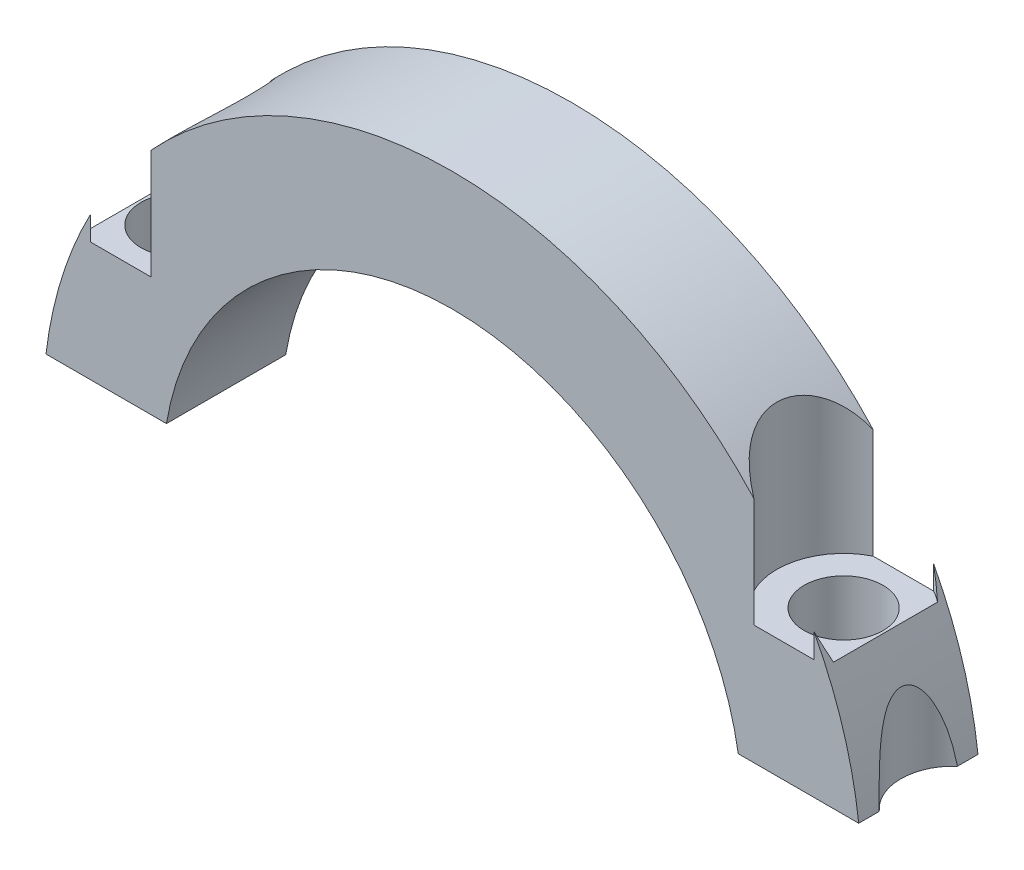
ISO-10303-21;
HEADER;
FILE_DESCRIPTION(('STEP AP214'),'2;1');
FILE_NAME('part.step','',(''),(''),'','','');
FILE_SCHEMA(('AUTOMOTIVE_DESIGN { 1 0 10303 214 1 1 1 1 }'));
ENDSEC;
DATA;
#1=APPLICATION_CONTEXT('core data for automotive mechanical design processes');
#2=APPLICATION_PROTOCOL_DEFINITION('international standard','automotive_design',2000,#1);
#3=PRODUCT_CONTEXT('',#1,'mechanical');
#4=PRODUCT('Part','Part','',(#3));
#5=PRODUCT_RELATED_PRODUCT_CATEGORY('part','',(#4));
#6=PRODUCT_DEFINITION_FORMATION('','',#4);
#7=PRODUCT_DEFINITION_CONTEXT('part definition',#1,'design');
#8=PRODUCT_DEFINITION('design','',#6,#7);
#9=PRODUCT_DEFINITION_SHAPE('','',#8);
#10=(LENGTH_UNIT() NAMED_UNIT(*) SI_UNIT(.MILLI.,.METRE.));
#11=(NAMED_UNIT(*) PLANE_ANGLE_UNIT() SI_UNIT($,.RADIAN.));
#12=(NAMED_UNIT(*) SI_UNIT($,.STERADIAN.) SOLID_ANGLE_UNIT());
#13=UNCERTAINTY_MEASURE_WITH_UNIT(LENGTH_MEASURE(1.E-05),#10,'distance_accuracy_value','');
#14=(GEOMETRIC_REPRESENTATION_CONTEXT(3) GLOBAL_UNCERTAINTY_ASSIGNED_CONTEXT((#13)) GLOBAL_UNIT_ASSIGNED_CONTEXT((#10,
#11,#12)) REPRESENTATION_CONTEXT('',''));
#15=CARTESIAN_POINT('',(0.,0.,0.));
#16=DIRECTION('',(0.,0.,1.));
#17=DIRECTION('',(1.,0.,0.));
#18=AXIS2_PLACEMENT_3D('',#15,#16,#17);
#19=CARTESIAN_POINT('',(0.,0.,2.5));
#20=DIRECTION('',(0.,0.,-1.));
#21=DIRECTION('',(-1.,0.,0.));
#22=AXIS2_PLACEMENT_3D('',#19,#20,#21);
#23=CYLINDRICAL_SURFACE('',#22,17.15);
#24=CARTESIAN_POINT('',(0.,0.,2.5));
#25=DIRECTION('',(0.,0.,1.));
#26=DIRECTION('',(-1.,0.,0.));
#27=AXIS2_PLACEMENT_3D('',#24,#25,#26);
#28=CIRCLE('',#27,17.15);
#29=CARTESIAN_POINT('',(12.6390479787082,11.5921079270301,2.5));
#30=VERTEX_POINT('',#29);
#31=CARTESIAN_POINT('',(-12.6390479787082,11.5921079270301,2.5));
#32=VERTEX_POINT('',#31);
#33=EDGE_CURVE('E385',#30,#32,#28,.T.);
#34=ORIENTED_EDGE('',*,*,#33,.F.);
#35=CARTESIAN_POINT('',(12.6390479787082,11.5921079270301,2.5));
#36=CARTESIAN_POINT('',(12.5632864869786,11.6747349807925,2.46177525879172));
#37=CARTESIAN_POINT('',(12.4876079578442,11.7555993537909,2.4192922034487));
#38=CARTESIAN_POINT('',(12.3372460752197,11.9132962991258,2.32502088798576));
#39=CARTESIAN_POINT('',(12.2625669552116,11.9901143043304,2.27320163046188));
#40=CARTESIAN_POINT('',(12.1148711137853,12.139338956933,2.15918716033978));
#41=CARTESIAN_POINT('',(12.0418765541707,12.2116974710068,2.09689918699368));
#42=CARTESIAN_POINT('',(11.8998874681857,12.3501008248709,1.96192024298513));
#43=CARTESIAN_POINT('',(11.8308869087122,12.4161552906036,1.88924557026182));
#44=CARTESIAN_POINT('',(11.6840475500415,12.5545924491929,1.71612679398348));
#45=CARTESIAN_POINT('',(11.6075642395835,12.6252123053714,1.61308330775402));
#46=CARTESIAN_POINT('',(11.4669244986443,12.7530849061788,1.39183664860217));
#47=CARTESIAN_POINT('',(11.402724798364,12.8103847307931,1.27368922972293));
#48=CARTESIAN_POINT('',(11.3182193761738,12.8849466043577,1.08591396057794));
#49=CARTESIAN_POINT('',(11.2919093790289,12.9079936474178,1.02119261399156));
#50=CARTESIAN_POINT('',(11.2438669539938,12.9498636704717,0.888767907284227));
#51=CARTESIAN_POINT('',(11.222132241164,12.9686887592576,0.821066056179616));
#52=CARTESIAN_POINT('',(11.1836722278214,13.0018700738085,0.683146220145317));
#53=CARTESIAN_POINT('',(11.1669491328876,13.0162243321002,0.61292714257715));
#54=CARTESIAN_POINT('',(11.1388873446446,13.0402462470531,0.470662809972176));
#55=CARTESIAN_POINT('',(11.1275478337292,13.0499146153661,0.398617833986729));
#56=CARTESIAN_POINT('',(11.1041891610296,13.0698095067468,0.199180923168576));
#57=CARTESIAN_POINT('',(11.0979523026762,13.0750899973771,0.0705260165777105));
#58=CARTESIAN_POINT('',(11.1032389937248,13.0705999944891,-0.186029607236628));
#59=CARTESIAN_POINT('',(11.1147536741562,13.0608370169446,-0.313930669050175));
#60=CARTESIAN_POINT('',(11.1534397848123,13.0278111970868,-0.557375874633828));
#61=CARTESIAN_POINT('',(11.179615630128,13.0054061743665,-0.673198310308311));
#62=CARTESIAN_POINT('',(11.2452850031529,12.9486654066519,-0.897886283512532));
#63=CARTESIAN_POINT('',(11.2847796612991,12.9143286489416,-1.00675122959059));
#64=CARTESIAN_POINT('',(11.3777408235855,12.8325192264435,-1.22178003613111));
#65=CARTESIAN_POINT('',(11.4319067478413,12.7843788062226,-1.32738427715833));
#66=CARTESIAN_POINT('',(11.550188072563,12.677618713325,-1.52704906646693));
#67=CARTESIAN_POINT('',(11.6143095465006,12.6189926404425,-1.62110250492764));
#68=CARTESIAN_POINT('',(11.7806017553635,12.4642648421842,-1.83688917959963));
#69=CARTESIAN_POINT('',(11.886869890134,12.3632021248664,-1.95191648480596));
#70=CARTESIAN_POINT('',(12.1082908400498,12.1464339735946,-2.15700045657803));
#71=CARTESIAN_POINT('',(12.223460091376,12.0307011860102,-2.24700944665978));
#72=CARTESIAN_POINT('',(12.3898300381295,11.858318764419,-2.35858514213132));
#73=CARTESIAN_POINT('',(12.4395613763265,11.8061478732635,-2.38965791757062));
#74=CARTESIAN_POINT('',(12.5391860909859,11.7002805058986,-2.44775195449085));
#75=CARTESIAN_POINT('',(12.5890775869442,11.6465924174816,-2.47479169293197));
#76=CARTESIAN_POINT('',(12.6390479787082,11.5921079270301,-2.5));
#77=B_SPLINE_CURVE_WITH_KNOTS('',3,(#35,#36,#37,#38,#39,#40,#41,#42,#43,#44,#45,#46,#47,#48,#49,
#50,#51,#52,#53,#54,#55,#56,#57,#58,#59,#60,#61,#62,#63,#64,#65,#66,#67,#68,#69,#70,#71,#72,#73,
#74,#75,#76),.UNSPECIFIED.,.F.,.F.,(4,2,2,2,2,2,2,2,2,2,2,2,2,2,2,2,2,2,2,2,4),(0.,
0.355369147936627,0.711940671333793,1.07185659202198,1.43121383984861,1.86896240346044,
2.30513937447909,2.52557059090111,2.7458914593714,2.96630914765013,3.18669335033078,
3.57119488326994,3.95550437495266,4.31642331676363,4.67737289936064,5.06010828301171,
5.44307808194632,5.99916162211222,6.55629771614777,6.79167534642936,7.02593910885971),.UNSPECIFIED.);
#78=CARTESIAN_POINT('',(12.6390479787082,11.5921079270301,-2.5));
#79=VERTEX_POINT('',#78);
#80=EDGE_CURVE('E161',#30,#79,#77,.T.);
#81=ORIENTED_EDGE('',*,*,#80,.T.);
#82=CARTESIAN_POINT('',(0.,0.,-2.5));
#83=DIRECTION('',(0.,0.,1.));
#84=DIRECTION('',(-1.,0.,0.));
#85=AXIS2_PLACEMENT_3D('',#82,#83,#84);
#86=CIRCLE('',#85,17.15);
#87=CARTESIAN_POINT('',(-12.6390479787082,11.5921079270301,-2.5));
#88=VERTEX_POINT('',#87);
#89=EDGE_CURVE('E359',#79,#88,#86,.T.);
#90=ORIENTED_EDGE('',*,*,#89,.T.);
#91=CARTESIAN_POINT('',(-12.6390479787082,11.5921079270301,2.5));
#92=CARTESIAN_POINT('',(-12.5632864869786,11.6747349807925,2.46177525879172));
#93=CARTESIAN_POINT('',(-12.4876079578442,11.7555993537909,2.4192922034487));
#94=CARTESIAN_POINT('',(-12.3372460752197,11.9132962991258,2.32502088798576));
#95=CARTESIAN_POINT('',(-12.2625669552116,11.9901143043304,2.27320163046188));
#96=CARTESIAN_POINT('',(-12.1148711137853,12.139338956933,2.15918716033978));
#97=CARTESIAN_POINT('',(-12.0418765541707,12.2116974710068,2.09689918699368));
#98=CARTESIAN_POINT('',(-11.8998874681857,12.3501008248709,1.96192024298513));
#99=CARTESIAN_POINT('',(-11.8308869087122,12.4161552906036,1.88924557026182));
#100=CARTESIAN_POINT('',(-11.6840475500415,12.5545924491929,1.71612679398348));
#101=CARTESIAN_POINT('',(-11.6075642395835,12.6252123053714,1.61308330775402));
#102=CARTESIAN_POINT('',(-11.4669244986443,12.7530849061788,1.39183664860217));
#103=CARTESIAN_POINT('',(-11.402724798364,12.8103847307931,1.27368922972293));
#104=CARTESIAN_POINT('',(-11.3182193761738,12.8849466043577,1.08591396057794));
#105=CARTESIAN_POINT('',(-11.2919093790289,12.9079936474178,1.02119261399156));
#106=CARTESIAN_POINT('',(-11.2438669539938,12.9498636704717,0.888767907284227));
#107=CARTESIAN_POINT('',(-11.222132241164,12.9686887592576,0.821066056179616));
#108=CARTESIAN_POINT('',(-11.1836722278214,13.0018700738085,0.683146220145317));
#109=CARTESIAN_POINT('',(-11.1669491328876,13.0162243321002,0.61292714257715));
#110=CARTESIAN_POINT('',(-11.1388873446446,13.0402462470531,0.470662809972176));
#111=CARTESIAN_POINT('',(-11.1275478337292,13.0499146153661,0.398617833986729));
#112=CARTESIAN_POINT('',(-11.1041891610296,13.0698095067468,0.199180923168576));
#113=CARTESIAN_POINT('',(-11.0979523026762,13.0750899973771,0.0705260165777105));
#114=CARTESIAN_POINT('',(-11.1032389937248,13.0705999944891,-0.186029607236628));
#115=CARTESIAN_POINT('',(-11.1147536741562,13.0608370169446,-0.313930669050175));
#116=CARTESIAN_POINT('',(-11.1534397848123,13.0278111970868,-0.557375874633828));
#117=CARTESIAN_POINT('',(-11.179615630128,13.0054061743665,-0.673198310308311));
#118=CARTESIAN_POINT('',(-11.2452850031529,12.9486654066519,-0.897886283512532));
#119=CARTESIAN_POINT('',(-11.2847796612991,12.9143286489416,-1.00675122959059));
#120=CARTESIAN_POINT('',(-11.3777408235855,12.8325192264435,-1.22178003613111));
#121=CARTESIAN_POINT('',(-11.4319067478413,12.7843788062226,-1.32738427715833));
#122=CARTESIAN_POINT('',(-11.550188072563,12.677618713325,-1.52704906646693));
#123=CARTESIAN_POINT('',(-11.6143095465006,12.6189926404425,-1.62110250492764));
#124=CARTESIAN_POINT('',(-11.7806017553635,12.4642648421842,-1.83688917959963));
#125=CARTESIAN_POINT('',(-11.886869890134,12.3632021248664,-1.95191648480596));
#126=CARTESIAN_POINT('',(-12.1082908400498,12.1464339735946,-2.15700045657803));
#127=CARTESIAN_POINT('',(-12.223460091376,12.0307011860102,-2.24700944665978));
#128=CARTESIAN_POINT('',(-12.3898300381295,11.858318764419,-2.35858514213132));
#129=CARTESIAN_POINT('',(-12.4395613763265,11.8061478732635,-2.38965791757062));
#130=CARTESIAN_POINT('',(-12.5391860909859,11.7002805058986,-2.44775195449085));
#131=CARTESIAN_POINT('',(-12.5890775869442,11.6465924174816,-2.47479169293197));
#132=CARTESIAN_POINT('',(-12.6390479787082,11.5921079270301,-2.5));
#133=B_SPLINE_CURVE_WITH_KNOTS('',3,(#91,#92,#93,#94,#95,#96,#97,#98,#99,#100,#101,#102,#103,
#104,#105,#106,#107,#108,#109,#110,#111,#112,#113,#114,#115,#116,#117,#118,#119,#120,#121,#122,
#123,#124,#125,#126,#127,#128,#129,#130,#131,#132),.UNSPECIFIED.,.F.,.F.,(4,2,2,2,2,2,2,2,2,2,2,
2,2,2,2,2,2,2,2,2,4),(0.,0.355369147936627,0.711940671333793,1.07185659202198,1.43121383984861,
1.86896240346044,2.30513937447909,2.52557059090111,2.7458914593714,2.96630914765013,
3.18669335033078,3.57119488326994,3.95550437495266,4.31642331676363,4.67737289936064,
5.06010828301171,5.44307808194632,5.99916162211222,6.55629771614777,6.79167534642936,
7.02593910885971),.UNSPECIFIED.);
#134=EDGE_CURVE('E274',#32,#88,#133,.T.);
#135=ORIENTED_EDGE('',*,*,#134,.F.);
#136=EDGE_LOOP('',(#34,#81,#90,#135));
#137=FACE_BOUND('',#136,.T.);
#138=ADVANCED_FACE('F42',(#137),#23,.T.);
#139=CARTESIAN_POINT('',(13.9,17.15,0.));
#140=DIRECTION('',(0.,-1.,0.));
#141=DIRECTION('',(0.,0.,-1.));
#142=AXIS2_PLACEMENT_3D('',#139,#140,#141);
#143=CYLINDRICAL_SURFACE('',#142,1.65);
#144=CARTESIAN_POINT('',(13.9,2.,0.));
#145=DIRECTION('',(0.,1.,0.));
#146=DIRECTION('',(0.,0.,-1.));
#147=AXIS2_PLACEMENT_3D('',#144,#145,#146);
#148=CIRCLE('',#147,1.65);
#149=CARTESIAN_POINT('',(13.9,2.,-1.65));
#150=VERTEX_POINT('',#149);
#151=EDGE_CURVE('E231',#150,#150,#148,.T.);
#152=ORIENTED_EDGE('',*,*,#151,.F.);
#153=EDGE_LOOP('',(#152));
#154=FACE_BOUND('',#153,.T.);
#155=CARTESIAN_POINT('',(13.9,7.,0.));
#156=DIRECTION('',(0.,1.,0.));
#157=DIRECTION('',(0.,0.,1.));
#158=AXIS2_PLACEMENT_3D('',#155,#156,#157);
#159=CIRCLE('',#158,1.65);
#160=CARTESIAN_POINT('',(13.9,7.,1.65));
#161=VERTEX_POINT('',#160);
#162=EDGE_CURVE('E175',#161,#161,#159,.T.);
#163=ORIENTED_EDGE('',*,*,#162,.T.);
#164=EDGE_LOOP('',(#163));
#165=FACE_BOUND('',#164,.T.);
#166=ADVANCED_FACE('F209',(#154,#165),#143,.F.);
#167=CARTESIAN_POINT('',(17.0329827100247,2.,-2.5));
#168=VERTEX_POINT('',#167);
#169=CARTESIAN_POINT('',(15.1609520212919,8.01673461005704,-2.5));
#170=VERTEX_POINT('',#169);
#171=EDGE_CURVE('E351',#168,#170,#86,.T.);
#172=ORIENTED_EDGE('',*,*,#171,.T.);
#173=CARTESIAN_POINT('',(15.1609520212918,8.01673461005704,-2.5));
#174=CARTESIAN_POINT('',(15.2055486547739,7.93239589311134,-2.47750353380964));
#175=CARTESIAN_POINT('',(15.2493214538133,7.84791056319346,-2.45393127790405));
#176=CARTESIAN_POINT('',(15.3351880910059,7.67876892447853,-2.40472147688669));
#177=CARTESIAN_POINT('',(15.3772831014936,7.59411278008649,-2.37908541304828));
#178=CARTESIAN_POINT('',(15.4598260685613,7.42463210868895,-2.32580224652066));
#179=CARTESIAN_POINT('',(15.5002740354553,7.33980758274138,-2.29815515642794));
#180=CARTESIAN_POINT('',(15.5795526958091,7.16999497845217,-2.24086859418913));
#181=CARTESIAN_POINT('',(15.6183822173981,7.08500682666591,-2.21122771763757));
#182=CARTESIAN_POINT('',(15.6563884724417,6.99999999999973,-2.18061907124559));
#183=B_SPLINE_CURVE_WITH_KNOTS('',3,(#173,#174,#175,#176,#177,#178,#179,#180,#181,#182),
.UNSPECIFIED.,.F.,.F.,(4,2,2,2,4),(0.,0.294048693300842,0.587888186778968,0.881725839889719,
1.1757726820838),.UNSPECIFIED.);
#184=CARTESIAN_POINT('',(15.6563884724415,7.,-2.18061907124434));
#185=VERTEX_POINT('',#184);
#186=EDGE_CURVE('E166',#170,#185,#183,.T.);
#187=ORIENTED_EDGE('',*,*,#186,.T.);
#188=DIRECTION('',(0.,0.,-1.));
#189=VECTOR('',#188,1.);
#190=CARTESIAN_POINT('',(15.6563884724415,7.,2.5));
#191=LINE('',#190,#189);
#192=CARTESIAN_POINT('',(15.6563884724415,7.,2.18061907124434));
#193=VERTEX_POINT('',#192);
#194=EDGE_CURVE('E183',#193,#185,#191,.T.);
#195=ORIENTED_EDGE('',*,*,#194,.F.);
#196=CARTESIAN_POINT('',(15.6563884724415,7.,2.18061907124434));
#197=CARTESIAN_POINT('',(15.6183822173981,7.08500682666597,2.21122771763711));
#198=CARTESIAN_POINT('',(15.5795526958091,7.16999497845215,2.24086859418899));
#199=CARTESIAN_POINT('',(15.5002740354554,7.33980758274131,2.29815515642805));
#200=CARTESIAN_POINT('',(15.4598260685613,7.42463210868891,2.32580224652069));
#201=CARTESIAN_POINT('',(15.3772831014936,7.59411278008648,2.37908541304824));
#202=CARTESIAN_POINT('',(15.3351880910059,7.67876892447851,2.40472147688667));
#203=CARTESIAN_POINT('',(15.2493214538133,7.84791056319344,2.45393127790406));
#204=CARTESIAN_POINT('',(15.2055486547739,7.93239589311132,2.47750353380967));
#205=CARTESIAN_POINT('',(15.1609520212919,8.01673461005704,2.5));
#206=B_SPLINE_CURVE_WITH_KNOTS('',3,(#196,#197,#198,#199,#200,#201,#202,#203,#204,#205),
.UNSPECIFIED.,.F.,.F.,(4,2,2,2,4),(0.,0.294046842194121,0.587884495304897,0.881723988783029,
1.17577268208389),.UNSPECIFIED.);
#207=CARTESIAN_POINT('',(15.1609520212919,8.01673461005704,2.5));
#208=VERTEX_POINT('',#207);
#209=EDGE_CURVE('E222',#193,#208,#206,.T.);
#210=ORIENTED_EDGE('',*,*,#209,.T.);
#211=CARTESIAN_POINT('',(17.0329827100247,2.,2.5));
#212=VERTEX_POINT('',#211);
#213=EDGE_CURVE('E383',#212,#208,#28,.T.);
#214=ORIENTED_EDGE('',*,*,#213,.F.);
#215=DIRECTION('',(0.,0.,-1.));
#216=VECTOR('',#215,1.);
#217=CARTESIAN_POINT('',(17.0329827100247,2.,2.5));
#218=LINE('',#217,#216);
#219=CARTESIAN_POINT('',(17.0329827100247,2.,1.6394695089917));
#220=VERTEX_POINT('',#219);
#221=EDGE_CURVE('E403',#212,#220,#218,.T.);
#222=ORIENTED_EDGE('',*,*,#221,.T.);
#223=CARTESIAN_POINT('',(17.0329827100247,2.,-1.63946950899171));
#224=CARTESIAN_POINT('',(17.0224368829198,2.08981881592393,-1.63002604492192));
#225=CARTESIAN_POINT('',(17.0111887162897,2.17947409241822,-1.61978447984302));
#226=CARTESIAN_POINT('',(16.9873076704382,2.3583936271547,-1.59750880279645));
#227=CARTESIAN_POINT('',(16.9746745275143,2.44765780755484,-1.58547434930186));
#228=CARTESIAN_POINT('',(16.9479785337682,2.62615825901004,-1.55935248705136));
#229=CARTESIAN_POINT('',(16.9339086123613,2.71539198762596,-1.54525476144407));
#230=CARTESIAN_POINT('',(16.9044318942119,2.89323634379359,-1.51479576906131));
#231=CARTESIAN_POINT('',(16.8890251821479,2.98184701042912,-1.49843464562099));
#232=CARTESIAN_POINT('',(16.8398646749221,3.25200999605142,-1.44444276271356));
#233=CARTESIAN_POINT('',(16.8039894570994,3.43241474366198,-1.40266407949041));
#234=CARTESIAN_POINT('',(16.7465844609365,3.6990109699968,-1.32908905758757));
#235=CARTESIAN_POINT('',(16.7268716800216,3.78712414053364,-1.30277709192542));
#236=CARTESIAN_POINT('',(16.6863896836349,3.96167996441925,-1.24581192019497));
#237=CARTESIAN_POINT('',(16.6656208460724,4.04812320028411,-1.21516026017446));
#238=CARTESIAN_POINT('',(16.6303727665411,4.19006094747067,-1.15981691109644));
#239=CARTESIAN_POINT('',(16.6161278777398,4.24618473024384,-1.1365887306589));
#240=CARTESIAN_POINT('',(16.5873589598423,4.35721354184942,-1.08748137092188));
#241=CARTESIAN_POINT('',(16.5728348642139,4.41211827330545,-1.06160155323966));
#242=CARTESIAN_POINT('',(16.5436976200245,4.52014215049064,-1.00689550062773));
#243=CARTESIAN_POINT('',(16.5290850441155,4.5732674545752,-0.978081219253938));
#244=CARTESIAN_POINT('',(16.4999058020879,4.67744947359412,-0.916934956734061));
#245=CARTESIAN_POINT('',(16.4853391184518,4.72850709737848,-0.884604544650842));
#246=CARTESIAN_POINT('',(16.4533381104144,4.83881584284,-0.808241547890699));
#247=CARTESIAN_POINT('',(16.4359772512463,4.89740109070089,-0.763198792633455));
#248=CARTESIAN_POINT('',(16.4024740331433,5.00846168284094,-0.665616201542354));
#249=CARTESIAN_POINT('',(16.3863302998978,5.06094395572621,-0.613085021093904));
#250=CARTESIAN_POINT('',(16.3612183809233,5.141422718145,-0.516959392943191));
#251=CARTESIAN_POINT('',(16.3515821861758,5.17195202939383,-0.475684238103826));
#252=CARTESIAN_POINT('',(16.3341676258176,5.22669015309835,-0.388749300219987));
#253=CARTESIAN_POINT('',(16.326386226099,5.25090929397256,-0.343096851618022));
#254=CARTESIAN_POINT('',(16.3148307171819,5.28668879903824,-0.257829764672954));
#255=CARTESIAN_POINT('',(16.3105583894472,5.29983892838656,-0.218957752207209));
#256=CARTESIAN_POINT('',(16.3040631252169,5.31978740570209,-0.139449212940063));
#257=CARTESIAN_POINT('',(16.3018380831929,5.32659227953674,-0.0988145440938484));
#258=CARTESIAN_POINT('',(16.2996794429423,5.33319453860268,-0.0167360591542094));
#259=CARTESIAN_POINT('',(16.2997553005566,5.33296300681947,0.02471039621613));
#260=CARTESIAN_POINT('',(16.3022132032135,5.325444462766,0.10689112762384));
#261=CARTESIAN_POINT('',(16.3045963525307,5.31815407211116,0.14762505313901));
#262=CARTESIAN_POINT('',(16.3112211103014,5.29779864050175,0.225131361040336));
#263=CARTESIAN_POINT('',(16.3153591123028,5.28505521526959,0.261999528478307));
#264=CARTESIAN_POINT('',(16.3251238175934,5.25481547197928,0.333492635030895));
#265=CARTESIAN_POINT('',(16.3307510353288,5.23731751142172,0.368116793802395));
#266=CARTESIAN_POINT('',(16.3474945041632,5.1848924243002,0.458327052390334));
#267=CARTESIAN_POINT('',(16.3596939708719,5.14634412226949,0.511600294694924));
#268=CARTESIAN_POINT('',(16.3860299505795,5.06186653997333,0.611402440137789));
#269=CARTESIAN_POINT('',(16.400172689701,5.01591345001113,0.657908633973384));
#270=CARTESIAN_POINT('',(16.4282857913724,4.92301655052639,0.741468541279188));
#271=CARTESIAN_POINT('',(16.4421769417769,4.87645601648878,0.778983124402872));
#272=CARTESIAN_POINT('',(16.4703864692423,4.78031206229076,0.849777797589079));
#273=CARTESIAN_POINT('',(16.4847052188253,4.73072596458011,0.88305405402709));
#274=CARTESIAN_POINT('',(16.5134930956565,4.62923707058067,0.946039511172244));
#275=CARTESIAN_POINT('',(16.5279624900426,4.57732928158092,0.975740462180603));
#276=CARTESIAN_POINT('',(16.5568122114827,4.47185205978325,1.03199728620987));
#277=CARTESIAN_POINT('',(16.5711925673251,4.41828320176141,1.05855423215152));
#278=CARTESIAN_POINT('',(16.605512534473,4.28784973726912,1.11918704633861));
#279=CARTESIAN_POINT('',(16.6253423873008,4.21034529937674,1.1519462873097));
#280=CARTESIAN_POINT('',(16.6642954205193,4.053431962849,1.21305104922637));
#281=CARTESIAN_POINT('',(16.6834183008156,3.97402227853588,1.24139471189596));
#282=CARTESIAN_POINT('',(16.739509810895,3.73341720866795,1.32095888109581));
#283=CARTESIAN_POINT('',(16.7751430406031,3.57006589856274,1.36661602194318));
#284=CARTESIAN_POINT('',(16.8420810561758,3.23965100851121,1.44706965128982));
#285=CARTESIAN_POINT('',(16.8733782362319,3.07258148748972,1.48184718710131));
#286=CARTESIAN_POINT('',(16.9312015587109,2.73606593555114,1.542932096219));
#287=CARTESIAN_POINT('',(16.9577268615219,2.56661949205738,1.56923797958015));
#288=CARTESIAN_POINT('',(16.9910580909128,2.3304270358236,1.60101681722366));
#289=CARTESIAN_POINT('',(16.9999910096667,2.26434584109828,1.6093811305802));
#290=CARTESIAN_POINT('',(17.017068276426,2.13220708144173,1.62513037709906));
#291=CARTESIAN_POINT('',(17.0252153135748,2.06615026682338,1.6325186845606));
#292=CARTESIAN_POINT('',(17.0329827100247,2.,1.63946950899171));
#293=B_SPLINE_CURVE_WITH_KNOTS('',3,(#223,#224,#225,#226,#227,#228,#229,#230,#231,#232,#233,
#234,#235,#236,#237,#238,#239,#240,#241,#242,#243,#244,#245,#246,#247,#248,#249,#250,#251,#252,
#253,#254,#255,#256,#257,#258,#259,#260,#261,#262,#263,#264,#265,#266,#267,#268,#269,#270,#271,
#272,#273,#274,#275,#276,#277,#278,#279,#280,#281,#282,#283,#284,#285,#286,#287,#288,#289,#290,
#291,#292),.UNSPECIFIED.,.F.,.F.,(4,2,2,2,2,2,2,2,2,2,2,2,2,2,2,2,2,2,2,2,2,2,2,2,2,2,2,2,2,2,2,
2,2,2,4),(0.,0.272779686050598,0.545611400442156,0.819857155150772,1.09408555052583,
1.65929269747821,1.94134814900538,2.22330336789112,2.41041367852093,2.59756914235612,
2.78399060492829,2.97032921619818,3.19762644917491,3.42466306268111,3.58092181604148,
3.73692317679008,3.86019642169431,3.98334274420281,4.10699522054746,4.23070690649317,
4.34795490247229,4.46524345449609,4.6647207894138,4.8648528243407,5.04873792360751,
5.23278818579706,5.41725530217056,5.6016592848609,5.86082309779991,6.12009568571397,
6.6393794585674,7.15956287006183,7.67983771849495,7.88144452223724,8.0823349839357),.UNSPECIFIED.);
#294=CARTESIAN_POINT('',(17.0329827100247,2.,-1.6394695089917));
#295=VERTEX_POINT('',#294);
#296=EDGE_CURVE('E64',#295,#220,#293,.T.);
#297=ORIENTED_EDGE('',*,*,#296,.F.);
#298=EDGE_CURVE('E354',#295,#168,#218,.T.);
#299=ORIENTED_EDGE('',*,*,#298,.T.);
#300=EDGE_LOOP('',(#172,#187,#195,#210,#214,#222,#297,#299));
#301=FACE_BOUND('',#300,.T.);
#302=ADVANCED_FACE('F198',(#301),#23,.T.);
#303=CARTESIAN_POINT('',(-15.1609520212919,8.01673461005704,-2.5));
#304=CARTESIAN_POINT('',(-15.2055486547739,7.93239589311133,-2.47750353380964));
#305=CARTESIAN_POINT('',(-15.2493214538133,7.84791056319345,-2.45393127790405));
#306=CARTESIAN_POINT('',(-15.3351880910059,7.67876892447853,-2.40472147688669));
#307=CARTESIAN_POINT('',(-15.3772831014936,7.59411278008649,-2.37908541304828));
#308=CARTESIAN_POINT('',(-15.4598260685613,7.42463210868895,-2.32580224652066));
#309=CARTESIAN_POINT('',(-15.5002740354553,7.33980758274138,-2.29815515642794));
#310=CARTESIAN_POINT('',(-15.5795526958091,7.16999497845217,-2.24086859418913));
#311=CARTESIAN_POINT('',(-15.6183822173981,7.08500682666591,-2.21122771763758));
#312=CARTESIAN_POINT('',(-15.6563884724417,6.99999999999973,-2.18061907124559));
#313=B_SPLINE_CURVE_WITH_KNOTS('',3,(#303,#304,#305,#306,#307,#308,#309,#310,#311,#312),
.UNSPECIFIED.,.F.,.F.,(4,2,2,2,4),(0.,0.294048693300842,0.587888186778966,0.881725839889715,
1.1757726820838),.UNSPECIFIED.);
#314=CARTESIAN_POINT('',(-15.1609520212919,8.01673461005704,-2.5));
#315=VERTEX_POINT('',#314);
#316=CARTESIAN_POINT('',(-15.6563884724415,7.,-2.18061907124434));
#317=VERTEX_POINT('',#316);
#318=EDGE_CURVE('E266',#315,#317,#313,.T.);
#319=ORIENTED_EDGE('',*,*,#318,.F.);
#320=CARTESIAN_POINT('',(-17.0329827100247,2.,-2.5));
#321=VERTEX_POINT('',#320);
#322=EDGE_CURVE('E361',#315,#321,#86,.T.);
#323=ORIENTED_EDGE('',*,*,#322,.T.);
#324=DIRECTION('',(0.,0.,-1.));
#325=VECTOR('',#324,1.);
#326=CARTESIAN_POINT('',(-17.0329827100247,2.,2.5));
#327=LINE('',#326,#325);
#328=CARTESIAN_POINT('',(-17.0329827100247,2.,-1.63946950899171));
#329=VERTEX_POINT('',#328);
#330=EDGE_CURVE('E438',#329,#321,#327,.T.);
#331=ORIENTED_EDGE('',*,*,#330,.F.);
#332=CARTESIAN_POINT('',(-17.0329827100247,2.,-1.6394695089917));
#333=CARTESIAN_POINT('',(-17.0224368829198,2.08981881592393,-1.63002604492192));
#334=CARTESIAN_POINT('',(-17.0111887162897,2.17947409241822,-1.61978447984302));
#335=CARTESIAN_POINT('',(-16.9873076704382,2.3583936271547,-1.59750880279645));
#336=CARTESIAN_POINT('',(-16.9746745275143,2.44765780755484,-1.58547434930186));
#337=CARTESIAN_POINT('',(-16.9479785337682,2.62615825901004,-1.55935248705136));
#338=CARTESIAN_POINT('',(-16.9339086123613,2.71539198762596,-1.54525476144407));
#339=CARTESIAN_POINT('',(-16.9044318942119,2.8932363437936,-1.51479576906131));
#340=CARTESIAN_POINT('',(-16.8890251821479,2.98184701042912,-1.49843464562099));
#341=CARTESIAN_POINT('',(-16.8398646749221,3.25200999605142,-1.44444276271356));
#342=CARTESIAN_POINT('',(-16.8039894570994,3.43241474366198,-1.40266407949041));
#343=CARTESIAN_POINT('',(-16.7465844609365,3.6990109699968,-1.32908905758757));
#344=CARTESIAN_POINT('',(-16.7268716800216,3.78712414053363,-1.30277709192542));
#345=CARTESIAN_POINT('',(-16.6863896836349,3.96167996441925,-1.24581192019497));
#346=CARTESIAN_POINT('',(-16.6656208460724,4.04812320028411,-1.21516026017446));
#347=CARTESIAN_POINT('',(-16.6303727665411,4.19006094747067,-1.15981691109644));
#348=CARTESIAN_POINT('',(-16.6161278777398,4.24618473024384,-1.1365887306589));
#349=CARTESIAN_POINT('',(-16.5873589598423,4.35721354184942,-1.08748137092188));
#350=CARTESIAN_POINT('',(-16.5728348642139,4.41211827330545,-1.06160155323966));
#351=CARTESIAN_POINT('',(-16.5436976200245,4.52014215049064,-1.00689550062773));
#352=CARTESIAN_POINT('',(-16.5290850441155,4.5732674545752,-0.978081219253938));
#353=CARTESIAN_POINT('',(-16.4999058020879,4.67744947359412,-0.916934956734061));
#354=CARTESIAN_POINT('',(-16.4853391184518,4.72850709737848,-0.884604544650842));
#355=CARTESIAN_POINT('',(-16.4533381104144,4.83881584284,-0.808241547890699));
#356=CARTESIAN_POINT('',(-16.4359772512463,4.89740109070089,-0.763198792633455));
#357=CARTESIAN_POINT('',(-16.4024740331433,5.00846168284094,-0.665616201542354));
#358=CARTESIAN_POINT('',(-16.3863302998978,5.06094395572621,-0.613085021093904));
#359=CARTESIAN_POINT('',(-16.3612183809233,5.141422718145,-0.516959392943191));
#360=CARTESIAN_POINT('',(-16.3515821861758,5.17195202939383,-0.475684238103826));
#361=CARTESIAN_POINT('',(-16.3341676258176,5.22669015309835,-0.388749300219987));
#362=CARTESIAN_POINT('',(-16.326386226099,5.25090929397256,-0.343096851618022));
#363=CARTESIAN_POINT('',(-16.3148307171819,5.28668879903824,-0.257829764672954));
#364=CARTESIAN_POINT('',(-16.3105583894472,5.29983892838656,-0.218957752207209));
#365=CARTESIAN_POINT('',(-16.3040631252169,5.31978740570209,-0.139449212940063));
#366=CARTESIAN_POINT('',(-16.3018380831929,5.32659227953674,-0.0988145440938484));
#367=CARTESIAN_POINT('',(-16.2996794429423,5.33319453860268,-0.0167360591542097));
#368=CARTESIAN_POINT('',(-16.2997553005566,5.33296300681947,0.0247103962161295));
#369=CARTESIAN_POINT('',(-16.3022132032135,5.325444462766,0.106891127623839));
#370=CARTESIAN_POINT('',(-16.3045963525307,5.31815407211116,0.14762505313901));
#371=CARTESIAN_POINT('',(-16.3112211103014,5.29779864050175,0.225131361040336));
#372=CARTESIAN_POINT('',(-16.3153591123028,5.28505521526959,0.261999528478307));
#373=CARTESIAN_POINT('',(-16.3251238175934,5.25481547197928,0.333492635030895));
#374=CARTESIAN_POINT('',(-16.3307510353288,5.23731751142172,0.368116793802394));
#375=CARTESIAN_POINT('',(-16.3474945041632,5.1848924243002,0.458327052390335));
#376=CARTESIAN_POINT('',(-16.3596939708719,5.1463441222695,0.51160029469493));
#377=CARTESIAN_POINT('',(-16.3860299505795,5.06186653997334,0.611402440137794));
#378=CARTESIAN_POINT('',(-16.400172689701,5.01591345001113,0.657908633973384));
#379=CARTESIAN_POINT('',(-16.4282857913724,4.92301655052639,0.741468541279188));
#380=CARTESIAN_POINT('',(-16.442176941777,4.87645601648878,0.778983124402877));
#381=CARTESIAN_POINT('',(-16.4703864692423,4.78031206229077,0.849777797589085));
#382=CARTESIAN_POINT('',(-16.4847052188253,4.73072596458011,0.883054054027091));
#383=CARTESIAN_POINT('',(-16.5134930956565,4.62923707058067,0.946039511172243));
#384=CARTESIAN_POINT('',(-16.5279624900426,4.57732928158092,0.975740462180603));
#385=CARTESIAN_POINT('',(-16.5568122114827,4.47185205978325,1.03199728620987));
#386=CARTESIAN_POINT('',(-16.5711925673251,4.41828320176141,1.05855423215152));
#387=CARTESIAN_POINT('',(-16.605512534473,4.28784973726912,1.11918704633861));
#388=CARTESIAN_POINT('',(-16.6253423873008,4.21034529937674,1.1519462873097));
#389=CARTESIAN_POINT('',(-16.6642954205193,4.053431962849,1.21305104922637));
#390=CARTESIAN_POINT('',(-16.6834183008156,3.97402227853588,1.24139471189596));
#391=CARTESIAN_POINT('',(-16.739509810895,3.73341720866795,1.32095888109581));
#392=CARTESIAN_POINT('',(-16.7751430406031,3.57006589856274,1.36661602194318));
#393=CARTESIAN_POINT('',(-16.8420810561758,3.23965100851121,1.44706965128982));
#394=CARTESIAN_POINT('',(-16.8733782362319,3.07258148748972,1.48184718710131));
#395=CARTESIAN_POINT('',(-16.9312015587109,2.73606593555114,1.542932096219));
#396=CARTESIAN_POINT('',(-16.9577268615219,2.56661949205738,1.56923797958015));
#397=CARTESIAN_POINT('',(-16.9910580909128,2.3304270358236,1.60101681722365));
#398=CARTESIAN_POINT('',(-16.9999910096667,2.26434584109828,1.6093811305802));
#399=CARTESIAN_POINT('',(-17.017068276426,2.13220708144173,1.62513037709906));
#400=CARTESIAN_POINT('',(-17.0252153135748,2.06615026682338,1.6325186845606));
#401=CARTESIAN_POINT('',(-17.0329827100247,2.,1.63946950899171));
#402=B_SPLINE_CURVE_WITH_KNOTS('',3,(#332,#333,#334,#335,#336,#337,#338,#339,#340,#341,#342,
#343,#344,#345,#346,#347,#348,#349,#350,#351,#352,#353,#354,#355,#356,#357,#358,#359,#360,#361,
#362,#363,#364,#365,#366,#367,#368,#369,#370,#371,#372,#373,#374,#375,#376,#377,#378,#379,#380,
#381,#382,#383,#384,#385,#386,#387,#388,#389,#390,#391,#392,#393,#394,#395,#396,#397,#398,#399,
#400,#401),.UNSPECIFIED.,.F.,.F.,(4,2,2,2,2,2,2,2,2,2,2,2,2,2,2,2,2,2,2,2,2,2,2,2,2,2,2,2,2,2,2,
2,2,2,4),(0.,0.272779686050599,0.545611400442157,0.819857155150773,1.09408555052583,
1.65929269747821,1.94134814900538,2.22330336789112,2.41041367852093,2.59756914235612,
2.78399060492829,2.97032921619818,3.19762644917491,3.42466306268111,3.58092181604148,
3.73692317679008,3.86019642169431,3.98334274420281,4.10699522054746,4.23070690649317,
4.34795490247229,4.46524345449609,4.6647207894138,4.8648528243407,5.04873792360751,
5.23278818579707,5.41725530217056,5.6016592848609,5.86082309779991,6.12009568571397,
6.6393794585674,7.15956287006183,7.67983771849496,7.88144452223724,8.0823349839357),.UNSPECIFIED.);
#403=CARTESIAN_POINT('',(-17.0329827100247,2.,1.63946950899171));
#404=VERTEX_POINT('',#403);
#405=EDGE_CURVE('E300',#329,#404,#402,.T.);
#406=ORIENTED_EDGE('',*,*,#405,.T.);
#407=CARTESIAN_POINT('',(-17.0329827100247,2.,2.5));
#408=VERTEX_POINT('',#407);
#409=EDGE_CURVE('E441',#408,#404,#327,.T.);
#410=ORIENTED_EDGE('',*,*,#409,.F.);
#411=CARTESIAN_POINT('',(-15.1609520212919,8.01673461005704,2.5));
#412=VERTEX_POINT('',#411);
#413=EDGE_CURVE('E386',#412,#408,#28,.T.);
#414=ORIENTED_EDGE('',*,*,#413,.F.);
#415=CARTESIAN_POINT('',(-15.6563884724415,7.,2.18061907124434));
#416=CARTESIAN_POINT('',(-15.6183822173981,7.08500682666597,2.21122771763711));
#417=CARTESIAN_POINT('',(-15.5795526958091,7.16999497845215,2.24086859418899));
#418=CARTESIAN_POINT('',(-15.5002740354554,7.33980758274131,2.29815515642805));
#419=CARTESIAN_POINT('',(-15.4598260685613,7.42463210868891,2.32580224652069));
#420=CARTESIAN_POINT('',(-15.3772831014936,7.59411278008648,2.37908541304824));
#421=CARTESIAN_POINT('',(-15.3351880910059,7.67876892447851,2.40472147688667));
#422=CARTESIAN_POINT('',(-15.2493214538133,7.84791056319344,2.45393127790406));
#423=CARTESIAN_POINT('',(-15.2055486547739,7.93239589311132,2.47750353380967));
#424=CARTESIAN_POINT('',(-15.1609520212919,8.01673461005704,2.5));
#425=B_SPLINE_CURVE_WITH_KNOTS('',3,(#415,#416,#417,#418,#419,#420,#421,#422,#423,#424),
.UNSPECIFIED.,.F.,.F.,(4,2,2,2,4),(0.,0.294046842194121,0.587884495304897,0.881723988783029,
1.17577268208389),.UNSPECIFIED.);
#426=CARTESIAN_POINT('',(-15.6563884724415,7.,2.18061907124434));
#427=VERTEX_POINT('',#426);
#428=EDGE_CURVE('E288',#427,#412,#425,.T.);
#429=ORIENTED_EDGE('',*,*,#428,.F.);
#430=DIRECTION('',(0.,0.,-1.));
#431=VECTOR('',#430,1.);
#432=CARTESIAN_POINT('',(-15.6563884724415,7.,2.5));
#433=LINE('',#432,#431);
#434=EDGE_CURVE('E454',#317,#427,#433,.F.);
#435=ORIENTED_EDGE('',*,*,#434,.F.);
#436=EDGE_LOOP('',(#319,#323,#331,#406,#410,#414,#429,#435));
#437=FACE_BOUND('',#436,.T.);
#438=ADVANCED_FACE('F321',(#437),#23,.T.);
#439=CARTESIAN_POINT('',(0.,0.,2.5));
#440=DIRECTION('',(0.,0.,-1.));
#441=DIRECTION('',(-1.,0.,0.));
#442=AXIS2_PLACEMENT_3D('',#439,#440,#441);
#443=PLANE('',#442);
#444=ORIENTED_EDGE('',*,*,#213,.T.);
#445=DIRECTION('',(0.,-1.,0.));
#446=VECTOR('',#445,1.);
#447=CARTESIAN_POINT('',(15.1609520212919,17.15,2.5));
#448=LINE('',#447,#446);
#449=CARTESIAN_POINT('',(15.1609520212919,7.,2.5));
#450=VERTEX_POINT('',#449);
#451=EDGE_CURVE('E181',#208,#450,#448,.T.);
#452=ORIENTED_EDGE('',*,*,#451,.T.);
#453=DIRECTION('',(1.,0.,0.));
#454=VECTOR('',#453,1.);
#455=CARTESIAN_POINT('',(0.,7.,2.5));
#456=LINE('',#455,#454);
#457=CARTESIAN_POINT('',(12.6390479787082,7.,2.5));
#458=VERTEX_POINT('',#457);
#459=EDGE_CURVE('E170',#458,#450,#456,.T.);
#460=ORIENTED_EDGE('',*,*,#459,.F.);
#461=DIRECTION('',(0.,-1.,0.));
#462=VECTOR('',#461,1.);
#463=CARTESIAN_POINT('',(12.6390479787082,17.15,2.5));
#464=LINE('',#463,#462);
#465=EDGE_CURVE('E155',#458,#30,#464,.F.);
#466=ORIENTED_EDGE('',*,*,#465,.T.);
#467=ORIENTED_EDGE('',*,*,#33,.T.);
#468=DIRECTION('',(0.,-1.,0.));
#469=VECTOR('',#468,1.);
#470=CARTESIAN_POINT('',(-12.6390479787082,17.15,2.5));
#471=LINE('',#470,#469);
#472=CARTESIAN_POINT('',(-12.6390479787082,7.,2.5));
#473=VERTEX_POINT('',#472);
#474=EDGE_CURVE('E282',#473,#32,#471,.F.);
#475=ORIENTED_EDGE('',*,*,#474,.F.);
#476=DIRECTION('',(1.,0.,0.));
#477=VECTOR('',#476,1.);
#478=CARTESIAN_POINT('',(0.,7.,2.5));
#479=LINE('',#478,#477);
#480=CARTESIAN_POINT('',(-15.1609520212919,7.,2.5));
#481=VERTEX_POINT('',#480);
#482=EDGE_CURVE('E434',#481,#473,#479,.T.);
#483=ORIENTED_EDGE('',*,*,#482,.F.);
#484=DIRECTION('',(0.,-1.,0.));
#485=VECTOR('',#484,1.);
#486=CARTESIAN_POINT('',(-15.1609520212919,17.15,2.5));
#487=LINE('',#486,#485);
#488=EDGE_CURVE('E286',#412,#481,#487,.T.);
#489=ORIENTED_EDGE('',*,*,#488,.F.);
#490=ORIENTED_EDGE('',*,*,#413,.T.);
#491=DIRECTION('',(1.,0.,0.));
#492=VECTOR('',#491,1.);
#493=CARTESIAN_POINT('',(-11.9842605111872,2.,2.5));
#494=LINE('',#493,#492);
#495=CARTESIAN_POINT('',(-11.9842605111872,2.,2.5));
#496=VERTEX_POINT('',#495);
#497=EDGE_CURVE('E379',#408,#496,#494,.T.);
#498=ORIENTED_EDGE('',*,*,#497,.T.);
#499=CARTESIAN_POINT('',(0.,0.,2.5));
#500=DIRECTION('',(0.,0.,-1.));
#501=DIRECTION('',(-1.,0.,0.));
#502=AXIS2_PLACEMENT_3D('',#499,#500,#501);
#503=CIRCLE('',#502,12.15);
#504=CARTESIAN_POINT('',(11.9842605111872,2.,2.5));
#505=VERTEX_POINT('',#504);
#506=EDGE_CURVE('E311',#496,#505,#503,.T.);
#507=ORIENTED_EDGE('',*,*,#506,.T.);
#508=DIRECTION('',(1.,0.,0.));
#509=VECTOR('',#508,1.);
#510=CARTESIAN_POINT('',(11.9842605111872,2.,2.5));
#511=LINE('',#510,#509);
#512=EDGE_CURVE('E387',#505,#212,#511,.T.);
#513=ORIENTED_EDGE('',*,*,#512,.T.);
#514=EDGE_LOOP('',(#444,#452,#460,#466,#467,#475,#483,#489,#490,#498,#507,#513));
#515=FACE_BOUND('',#514,.T.);
#516=ADVANCED_FACE('F180',(#515),#443,.F.);
#517=CARTESIAN_POINT('',(0.,0.,-2.5));
#518=DIRECTION('',(0.,0.,-1.));
#519=DIRECTION('',(-1.,0.,0.));
#520=AXIS2_PLACEMENT_3D('',#517,#518,#519);
#521=PLANE('',#520);
#522=DIRECTION('',(0.,-1.,0.));
#523=VECTOR('',#522,1.);
#524=CARTESIAN_POINT('',(15.1609520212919,17.15,-2.5));
#525=LINE('',#524,#523);
#526=CARTESIAN_POINT('',(15.1609520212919,7.,-2.5));
#527=VERTEX_POINT('',#526);
#528=EDGE_CURVE('E11',#170,#527,#525,.T.);
#529=ORIENTED_EDGE('',*,*,#528,.F.);
#530=ORIENTED_EDGE('',*,*,#171,.F.);
#531=DIRECTION('',(1.,0.,0.));
#532=VECTOR('',#531,1.);
#533=CARTESIAN_POINT('',(11.9842605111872,2.,-2.5));
#534=LINE('',#533,#532);
#535=CARTESIAN_POINT('',(11.9842605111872,2.,-2.5));
#536=VERTEX_POINT('',#535);
#537=EDGE_CURVE('E367',#536,#168,#534,.T.);
#538=ORIENTED_EDGE('',*,*,#537,.F.);
#539=CARTESIAN_POINT('',(0.,0.,-2.5));
#540=DIRECTION('',(0.,0.,-1.));
#541=DIRECTION('',(-1.,0.,0.));
#542=AXIS2_PLACEMENT_3D('',#539,#540,#541);
#543=CIRCLE('',#542,12.15);
#544=CARTESIAN_POINT('',(-11.9842605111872,2.,-2.5));
#545=VERTEX_POINT('',#544);
#546=EDGE_CURVE('E310',#545,#536,#543,.T.);
#547=ORIENTED_EDGE('',*,*,#546,.F.);
#548=DIRECTION('',(1.,0.,0.));
#549=VECTOR('',#548,1.);
#550=CARTESIAN_POINT('',(-11.9842605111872,2.,-2.5));
#551=LINE('',#550,#549);
#552=EDGE_CURVE('E358',#321,#545,#551,.T.);
#553=ORIENTED_EDGE('',*,*,#552,.F.);
#554=ORIENTED_EDGE('',*,*,#322,.F.);
#555=DIRECTION('',(0.,-1.,0.));
#556=VECTOR('',#555,1.);
#557=CARTESIAN_POINT('',(-15.1609520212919,17.15,-2.5));
#558=LINE('',#557,#556);
#559=CARTESIAN_POINT('',(-15.1609520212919,7.,-2.5));
#560=VERTEX_POINT('',#559);
#561=EDGE_CURVE('E402',#315,#560,#558,.T.);
#562=ORIENTED_EDGE('',*,*,#561,.T.);
#563=DIRECTION('',(1.,0.,0.));
#564=VECTOR('',#563,1.);
#565=CARTESIAN_POINT('',(0.,7.,-2.5));
#566=LINE('',#565,#564);
#567=CARTESIAN_POINT('',(-12.6390479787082,7.,-2.5));
#568=VERTEX_POINT('',#567);
#569=EDGE_CURVE('E417',#560,#568,#566,.T.);
#570=ORIENTED_EDGE('',*,*,#569,.T.);
#571=DIRECTION('',(0.,-1.,0.));
#572=VECTOR('',#571,1.);
#573=CARTESIAN_POINT('',(-12.6390479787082,17.15,-2.5));
#574=LINE('',#573,#572);
#575=EDGE_CURVE('E408',#568,#88,#574,.F.);
#576=ORIENTED_EDGE('',*,*,#575,.T.);
#577=ORIENTED_EDGE('',*,*,#89,.F.);
#578=DIRECTION('',(0.,-1.,0.));
#579=VECTOR('',#578,1.);
#580=CARTESIAN_POINT('',(12.6390479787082,17.15,-2.5));
#581=LINE('',#580,#579);
#582=CARTESIAN_POINT('',(12.6390479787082,7.,-2.5));
#583=VERTEX_POINT('',#582);
#584=EDGE_CURVE('E51',#583,#79,#581,.F.);
#585=ORIENTED_EDGE('',*,*,#584,.F.);
#586=DIRECTION('',(1.,0.,0.));
#587=VECTOR('',#586,1.);
#588=CARTESIAN_POINT('',(0.,7.,-2.5));
#589=LINE('',#588,#587);
#590=EDGE_CURVE('E173',#583,#527,#589,.T.);
#591=ORIENTED_EDGE('',*,*,#590,.T.);
#592=EDGE_LOOP('',(#529,#530,#538,#547,#553,#554,#562,#570,#576,#577,#585,#591));
#593=FACE_BOUND('',#592,.T.);
#594=ADVANCED_FACE('F320',(#593),#521,.T.);
#595=CARTESIAN_POINT('',(-13.9,17.15,0.));
#596=DIRECTION('',(0.,-1.,0.));
#597=DIRECTION('',(0.,0.,-1.));
#598=AXIS2_PLACEMENT_3D('',#595,#596,#597);
#599=CYLINDRICAL_SURFACE('',#598,1.65);
#600=CARTESIAN_POINT('',(-13.9,2.,0.));
#601=DIRECTION('',(0.,-1.,0.));
#602=DIRECTION('',(0.,0.,-1.));
#603=AXIS2_PLACEMENT_3D('',#600,#601,#602);
#604=CIRCLE('',#603,1.65);
#605=CARTESIAN_POINT('',(-13.9,2.,-1.65));
#606=VERTEX_POINT('',#605);
#607=EDGE_CURVE('E296',#606,#606,#604,.T.);
#608=ORIENTED_EDGE('',*,*,#607,.T.);
#609=EDGE_LOOP('',(#608));
#610=FACE_BOUND('',#609,.T.);
#611=CARTESIAN_POINT('',(-13.9,7.,0.));
#612=DIRECTION('',(0.,1.,0.));
#613=DIRECTION('',(0.,0.,1.));
#614=AXIS2_PLACEMENT_3D('',#611,#612,#613);
#615=CIRCLE('',#614,1.65);
#616=CARTESIAN_POINT('',(-13.9,7.,1.65));
#617=VERTEX_POINT('',#616);
#618=EDGE_CURVE('E414',#617,#617,#615,.F.);
#619=ORIENTED_EDGE('',*,*,#618,.F.);
#620=EDGE_LOOP('',(#619));
#621=FACE_BOUND('',#620,.T.);
#622=ADVANCED_FACE('F261',(#610,#621),#599,.F.);
#623=CARTESIAN_POINT('',(0.,0.,2.5));
#624=DIRECTION('',(0.,0.,-1.));
#625=DIRECTION('',(-1.,0.,0.));
#626=AXIS2_PLACEMENT_3D('',#623,#624,#625);
#627=CYLINDRICAL_SURFACE('',#626,12.15);
#628=ORIENTED_EDGE('',*,*,#546,.T.);
#629=DIRECTION('',(0.,0.,-1.));
#630=VECTOR('',#629,1.);
#631=CARTESIAN_POINT('',(11.9842605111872,2.,2.5));
#632=LINE('',#631,#630);
#633=EDGE_CURVE('E399',#505,#536,#632,.T.);
#634=ORIENTED_EDGE('',*,*,#633,.F.);
#635=ORIENTED_EDGE('',*,*,#506,.F.);
#636=DIRECTION('',(0.,0.,-1.));
#637=VECTOR('',#636,1.);
#638=CARTESIAN_POINT('',(-11.9842605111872,2.,2.5));
#639=LINE('',#638,#637);
#640=EDGE_CURVE('E382',#496,#545,#639,.T.);
#641=ORIENTED_EDGE('',*,*,#640,.T.);
#642=EDGE_LOOP('',(#628,#634,#635,#641));
#643=FACE_BOUND('',#642,.T.);
#644=ADVANCED_FACE('F44',(#643),#627,.F.);
#645=CARTESIAN_POINT('',(11.9842605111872,2.,2.5));
#646=DIRECTION('',(0.,1.,0.));
#647=DIRECTION('',(0.,0.,1.));
#648=AXIS2_PLACEMENT_3D('',#645,#646,#647);
#649=PLANE('',#648);
#650=ORIENTED_EDGE('',*,*,#151,.T.);
#651=EDGE_LOOP('',(#650));
#652=FACE_BOUND('',#651,.T.);
#653=CARTESIAN_POINT('',(18.5,2.,0.));
#654=DIRECTION('',(0.,1.,0.));
#655=DIRECTION('',(0.,0.,-1.));
#656=AXIS2_PLACEMENT_3D('',#653,#654,#655);
#657=CIRCLE('',#656,2.2);
#658=EDGE_CURVE('E230',#295,#220,#657,.T.);
#659=ORIENTED_EDGE('',*,*,#658,.T.);
#660=ORIENTED_EDGE('',*,*,#221,.F.);
#661=ORIENTED_EDGE('',*,*,#512,.F.);
#662=ORIENTED_EDGE('',*,*,#633,.T.);
#663=ORIENTED_EDGE('',*,*,#537,.T.);
#664=ORIENTED_EDGE('',*,*,#298,.F.);
#665=EDGE_LOOP('',(#659,#660,#661,#662,#663,#664));
#666=FACE_BOUND('',#665,.T.);
#667=ADVANCED_FACE('F325',(#652,#666),#649,.F.);
#668=CARTESIAN_POINT('',(-11.9842605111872,2.,2.5));
#669=DIRECTION('',(0.,1.,0.));
#670=DIRECTION('',(0.,0.,1.));
#671=AXIS2_PLACEMENT_3D('',#668,#669,#670);
#672=PLANE('',#671);
#673=ORIENTED_EDGE('',*,*,#607,.F.);
#674=EDGE_LOOP('',(#673));
#675=FACE_BOUND('',#674,.T.);
#676=ORIENTED_EDGE('',*,*,#409,.T.);
#677=CARTESIAN_POINT('',(-18.5,2.,0.));
#678=DIRECTION('',(0.,-1.,0.));
#679=DIRECTION('',(0.,0.,-1.));
#680=AXIS2_PLACEMENT_3D('',#677,#678,#679);
#681=CIRCLE('',#680,2.2);
#682=EDGE_CURVE('E295',#329,#404,#681,.T.);
#683=ORIENTED_EDGE('',*,*,#682,.F.);
#684=ORIENTED_EDGE('',*,*,#330,.T.);
#685=ORIENTED_EDGE('',*,*,#552,.T.);
#686=ORIENTED_EDGE('',*,*,#640,.F.);
#687=ORIENTED_EDGE('',*,*,#497,.F.);
#688=EDGE_LOOP('',(#676,#683,#684,#685,#686,#687));
#689=FACE_BOUND('',#688,.T.);
#690=ADVANCED_FACE('F316',(#675,#689),#672,.F.);
#691=CARTESIAN_POINT('',(-18.5,17.15,0.));
#692=DIRECTION('',(0.,-1.,0.));
#693=DIRECTION('',(0.,0.,-1.));
#694=AXIS2_PLACEMENT_3D('',#691,#692,#693);
#695=CYLINDRICAL_SURFACE('',#694,2.2);
#696=ORIENTED_EDGE('',*,*,#682,.T.);
#697=ORIENTED_EDGE('',*,*,#405,.F.);
#698=EDGE_LOOP('',(#696,#697));
#699=FACE_BOUND('',#698,.T.);
#700=ADVANCED_FACE('F259',(#699),#695,.F.);
#701=CARTESIAN_POINT('',(-13.9,17.15,0.));
#702=DIRECTION('',(0.,-1.,0.));
#703=DIRECTION('',(0.,0.,-1.));
#704=AXIS2_PLACEMENT_3D('',#701,#702,#703);
#705=CYLINDRICAL_SURFACE('',#704,2.8);
#706=ORIENTED_EDGE('',*,*,#428,.T.);
#707=ORIENTED_EDGE('',*,*,#488,.T.);
#708=CARTESIAN_POINT('',(-13.9,7.,0.));
#709=DIRECTION('',(0.,1.,0.));
#710=DIRECTION('',(0.,0.,1.));
#711=AXIS2_PLACEMENT_3D('',#708,#709,#710);
#712=CIRCLE('',#711,2.8);
#713=EDGE_CURVE('E243',#427,#481,#712,.T.);
#714=ORIENTED_EDGE('',*,*,#713,.F.);
#715=EDGE_LOOP('',(#706,#707,#714));
#716=FACE_BOUND('',#715,.T.);
#717=ADVANCED_FACE('F254',(#716),#705,.F.);
#718=ORIENTED_EDGE('',*,*,#474,.T.);
#719=ORIENTED_EDGE('',*,*,#134,.T.);
#720=ORIENTED_EDGE('',*,*,#575,.F.);
#721=EDGE_CURVE('E244',#473,#568,#712,.T.);
#722=ORIENTED_EDGE('',*,*,#721,.F.);
#723=EDGE_LOOP('',(#718,#719,#720,#722));
#724=FACE_BOUND('',#723,.T.);
#725=ADVANCED_FACE('F258',(#724),#705,.F.);
#726=ORIENTED_EDGE('',*,*,#318,.T.);
#727=EDGE_CURVE('E452',#560,#317,#712,.T.);
#728=ORIENTED_EDGE('',*,*,#727,.F.);
#729=ORIENTED_EDGE('',*,*,#561,.F.);
#730=EDGE_LOOP('',(#726,#728,#729));
#731=FACE_BOUND('',#730,.T.);
#732=ADVANCED_FACE('F252',(#731),#705,.F.);
#733=CARTESIAN_POINT('',(-13.9,7.,0.));
#734=DIRECTION('',(0.,1.,0.));
#735=DIRECTION('',(0.,0.,1.));
#736=AXIS2_PLACEMENT_3D('',#733,#734,#735);
#737=PLANE('',#736);
#738=ORIENTED_EDGE('',*,*,#618,.T.);
#739=EDGE_LOOP('',(#738));
#740=FACE_BOUND('',#739,.T.);
#741=ORIENTED_EDGE('',*,*,#434,.T.);
#742=ORIENTED_EDGE('',*,*,#713,.T.);
#743=ORIENTED_EDGE('',*,*,#482,.T.);
#744=ORIENTED_EDGE('',*,*,#721,.T.);
#745=ORIENTED_EDGE('',*,*,#569,.F.);
#746=ORIENTED_EDGE('',*,*,#727,.T.);
#747=EDGE_LOOP('',(#741,#742,#743,#744,#745,#746));
#748=FACE_BOUND('',#747,.T.);
#749=ADVANCED_FACE('F249',(#740,#748),#737,.T.);
#750=CARTESIAN_POINT('',(18.5,17.15,0.));
#751=DIRECTION('',(0.,-1.,0.));
#752=DIRECTION('',(0.,0.,-1.));
#753=AXIS2_PLACEMENT_3D('',#750,#751,#752);
#754=CYLINDRICAL_SURFACE('',#753,2.2);
#755=ORIENTED_EDGE('',*,*,#296,.T.);
#756=ORIENTED_EDGE('',*,*,#658,.F.);
#757=EDGE_LOOP('',(#755,#756));
#758=FACE_BOUND('',#757,.T.);
#759=ADVANCED_FACE('F207',(#758),#754,.F.);
#760=CARTESIAN_POINT('',(13.9,17.15,0.));
#761=DIRECTION('',(0.,-1.,0.));
#762=DIRECTION('',(0.,0.,-1.));
#763=AXIS2_PLACEMENT_3D('',#760,#761,#762);
#764=CYLINDRICAL_SURFACE('',#763,2.8);
#765=CARTESIAN_POINT('',(13.9,7.,0.));
#766=DIRECTION('',(0.,-1.,0.));
#767=DIRECTION('',(0.,0.,1.));
#768=AXIS2_PLACEMENT_3D('',#765,#766,#767);
#769=CIRCLE('',#768,2.8);
#770=EDGE_CURVE('E177',#193,#450,#769,.T.);
#771=ORIENTED_EDGE('',*,*,#770,.T.);
#772=ORIENTED_EDGE('',*,*,#451,.F.);
#773=ORIENTED_EDGE('',*,*,#209,.F.);
#774=EDGE_LOOP('',(#771,#772,#773));
#775=FACE_BOUND('',#774,.T.);
#776=ADVANCED_FACE('F201',(#775),#764,.F.);
#777=ORIENTED_EDGE('',*,*,#528,.T.);
#778=EDGE_CURVE('E58',#527,#185,#769,.T.);
#779=ORIENTED_EDGE('',*,*,#778,.T.);
#780=ORIENTED_EDGE('',*,*,#186,.F.);
#781=EDGE_LOOP('',(#777,#779,#780));
#782=FACE_BOUND('',#781,.T.);
#783=ADVANCED_FACE('F206',(#782),#764,.F.);
#784=EDGE_CURVE('E158',#458,#583,#769,.T.);
#785=ORIENTED_EDGE('',*,*,#784,.T.);
#786=ORIENTED_EDGE('',*,*,#584,.T.);
#787=ORIENTED_EDGE('',*,*,#80,.F.);
#788=ORIENTED_EDGE('',*,*,#465,.F.);
#789=EDGE_LOOP('',(#785,#786,#787,#788));
#790=FACE_BOUND('',#789,.T.);
#791=ADVANCED_FACE('F157',(#790),#764,.F.);
#792=CARTESIAN_POINT('',(13.9,7.,0.));
#793=DIRECTION('',(0.,1.,0.));
#794=DIRECTION('',(0.,0.,1.));
#795=AXIS2_PLACEMENT_3D('',#792,#793,#794);
#796=PLANE('',#795);
#797=ORIENTED_EDGE('',*,*,#162,.F.);
#798=EDGE_LOOP('',(#797));
#799=FACE_BOUND('',#798,.T.);
#800=ORIENTED_EDGE('',*,*,#194,.T.);
#801=ORIENTED_EDGE('',*,*,#778,.F.);
#802=ORIENTED_EDGE('',*,*,#590,.F.);
#803=ORIENTED_EDGE('',*,*,#784,.F.);
#804=ORIENTED_EDGE('',*,*,#459,.T.);
#805=ORIENTED_EDGE('',*,*,#770,.F.);
#806=EDGE_LOOP('',(#800,#801,#802,#803,#804,#805));
#807=FACE_BOUND('',#806,.T.);
#808=ADVANCED_FACE('F168',(#799,#807),#796,.T.);
#809=CLOSED_SHELL('',(#138,#166,#302,#438,#516,#594,#622,#644,#667,#690,#700,#717,#725,#732,
#749,#759,#776,#783,#791,#808));
#810=MANIFOLD_SOLID_BREP('B2',#809);
#811=ADVANCED_BREP_SHAPE_REPRESENTATION('',(#18,#810),#14);
#812=SHAPE_DEFINITION_REPRESENTATION(#9,#811);
ENDSEC;
END-ISO-10303-21;
